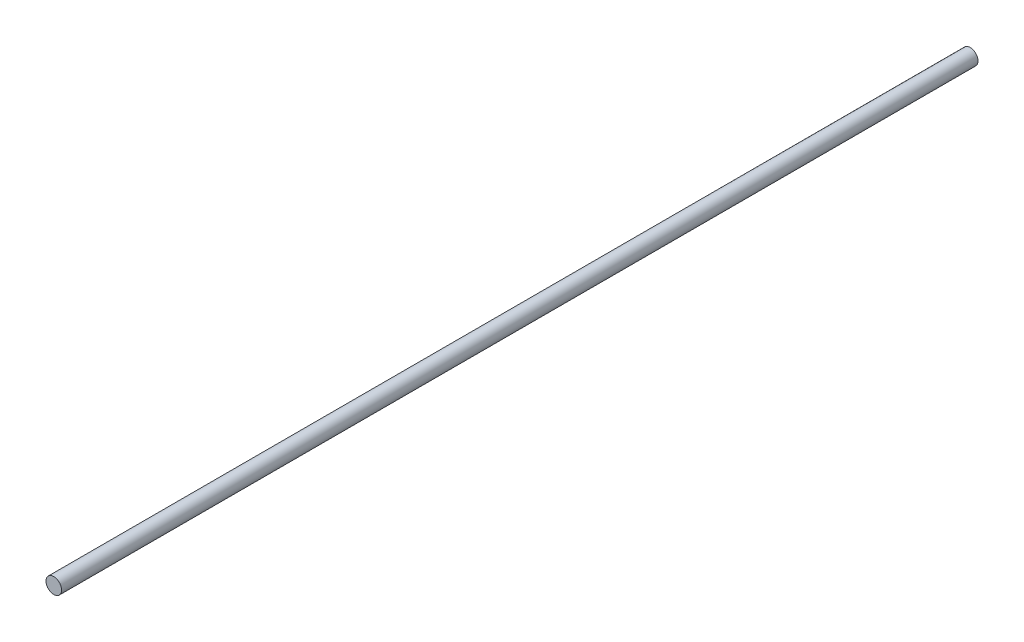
from build123d import *

# Parameters (mm, degrees)
SKETCH1_R           = 8.5
BOSS_EXTRUDE1_DEPTH = 1000


with BuildPart() as part:
    # Sketch1 → Boss-Extrude1 (new body)
    with BuildSketch(Plane.XY):
        Circle(SKETCH1_R)
    extrude(amount=BOSS_EXTRUDE1_DEPTH)


solid = part.part
